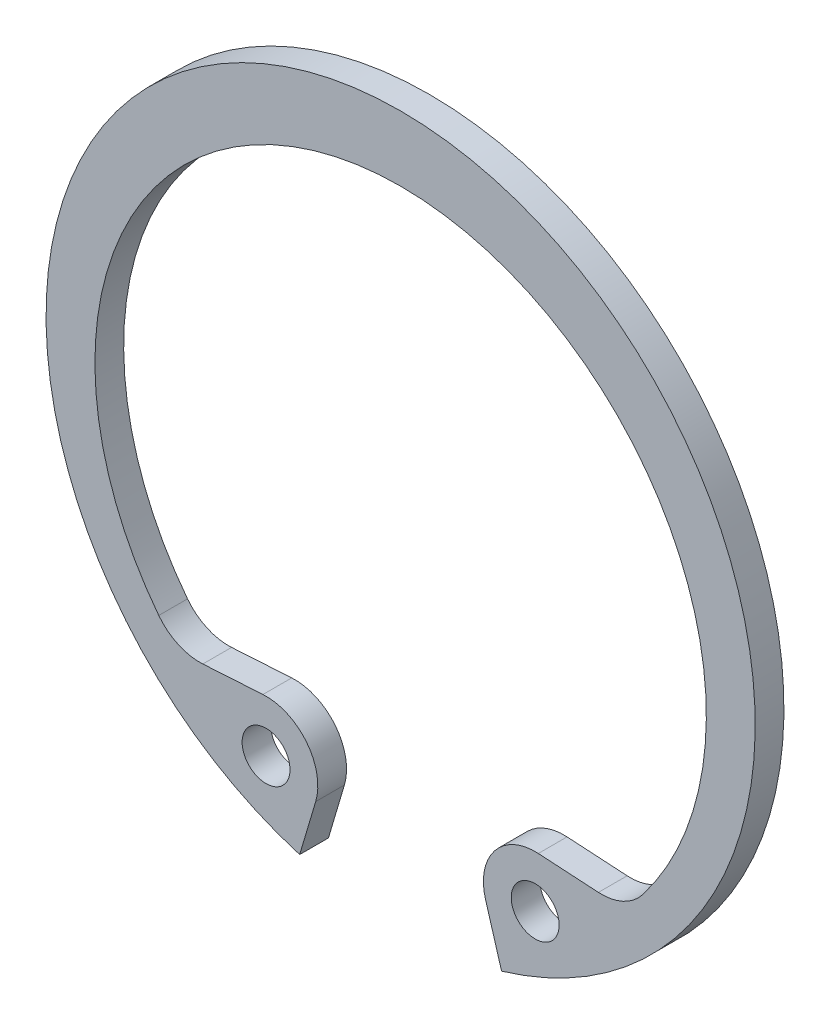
from build123d import *

# Parameters (mm, degrees)
ESQUISSE1_R          = 1.25
BASE_EXTRUSION_DEPTH = 1.5


with BuildPart() as part:
    # Esquisse1 → Base-Extrusion (new body)
    with BuildSketch(Plane.XY):
        with BuildLine():
            Line((4.431996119, -14.923384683), (5.266833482, -17.734442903))
            ThreePointArc((5.266833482, -17.734442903), (0, 18.5), (-5.266833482, -17.734442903))
            Line((-5.266833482, -17.734442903), (-4.431996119, -14.923384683))
            ThreePointArc((-4.431996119, -14.923384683), (-4.9060354, -12.475417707), (-7.183190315, -11.459631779))
            Line((-7.183190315, -11.459631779), (-10.319684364, -11.649240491))
            ThreePointArc((-10.319684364, -11.649240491), (-11.59869294, -11.412687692), (-12.618687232, -10.605574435))
            ThreePointArc((-12.618687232, -10.605574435), (0, 15.1), (12.618687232, -10.605574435))
            ThreePointArc((12.618687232, -10.605574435), (11.59869294, -11.412687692), (10.319684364, -11.649240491))
            Line((10.319684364, -11.649240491), (7.183190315, -11.459631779))
            ThreePointArc((7.183190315, -11.459631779), (4.9060354, -12.475417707), (4.431996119, -14.923384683))
        make_face()
        with Locations((7.020266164, -14.154711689)):
            Circle(ESQUISSE1_R, mode=Mode.SUBTRACT)
        with Locations(Location((-7.020266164, -14.154711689, 0), (0, 0, 180))):
            Circle(ESQUISSE1_R, mode=Mode.SUBTRACT)
    extrude(amount=BASE_EXTRUSION_DEPTH)


solid = part.part
